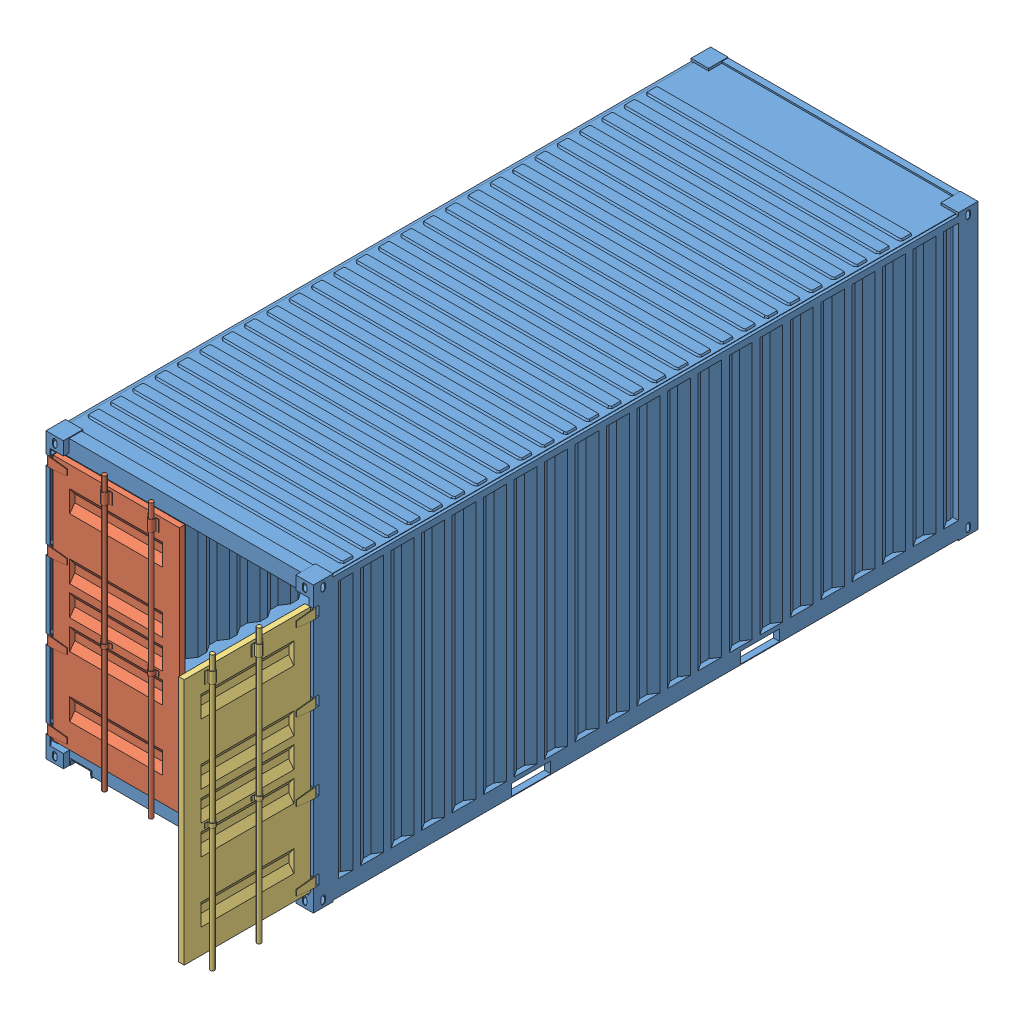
SolidWorks assembly User Library-20x08x08-SHIPPING-CONTAINER.sldasm, configuration Default (file format 4700). Lengths in mm.
Overall size (2478.09 2584.45 7223.13).
3 component instances, 3 part files, 0 mates.
Components (placement in the parent):
- User Library-20x08x08-SHIPPING-CONTAINER_Imported-1: User Library-20x08x08-SHIPPING-CONTAINER_Imported.sldprt [Default] at origin size (2432.05 2584.45 6048.38)
- User Library-20x08x08-SHIPPING-CONTAINER_Imported1-1: User Library-20x08x08-SHIPPING-CONTAINER_Imported1.sldprt [Default] at origin size (1210.31 2489.2 97.7)
- User Library-20x08x08-SHIPPING-CONTAINER_Imported2-1: User Library-20x08x08-SHIPPING-CONTAINER_Imported2.sldprt [Default] at origin size (97.7 2489.2 1210.31)
